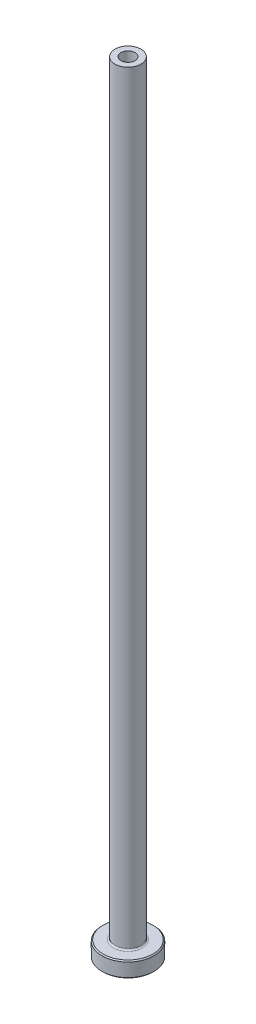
ISO-10303-21;
HEADER;
FILE_DESCRIPTION(('STEP AP214'),'2;1');
FILE_NAME('part.step','',(''),(''),'','','');
FILE_SCHEMA(('AUTOMOTIVE_DESIGN { 1 0 10303 214 1 1 1 1 }'));
ENDSEC;
DATA;
#1=APPLICATION_CONTEXT('core data for automotive mechanical design processes');
#2=APPLICATION_PROTOCOL_DEFINITION('international standard','automotive_design',2000,#1);
#3=PRODUCT_CONTEXT('',#1,'mechanical');
#4=PRODUCT('Part','Part','',(#3));
#5=PRODUCT_RELATED_PRODUCT_CATEGORY('part','',(#4));
#6=PRODUCT_DEFINITION_FORMATION('','',#4);
#7=PRODUCT_DEFINITION_CONTEXT('part definition',#1,'design');
#8=PRODUCT_DEFINITION('design','',#6,#7);
#9=PRODUCT_DEFINITION_SHAPE('','',#8);
#10=(LENGTH_UNIT() NAMED_UNIT(*) SI_UNIT(.MILLI.,.METRE.));
#11=(NAMED_UNIT(*) PLANE_ANGLE_UNIT() SI_UNIT($,.RADIAN.));
#12=(NAMED_UNIT(*) SI_UNIT($,.STERADIAN.) SOLID_ANGLE_UNIT());
#13=UNCERTAINTY_MEASURE_WITH_UNIT(LENGTH_MEASURE(1.E-05),#10,'distance_accuracy_value','');
#14=(GEOMETRIC_REPRESENTATION_CONTEXT(3) GLOBAL_UNCERTAINTY_ASSIGNED_CONTEXT((#13)) GLOBAL_UNIT_ASSIGNED_CONTEXT((#10,
#11,#12)) REPRESENTATION_CONTEXT('',''));
#15=CARTESIAN_POINT('',(0.,0.,0.));
#16=DIRECTION('',(0.,0.,1.));
#17=DIRECTION('',(1.,0.,0.));
#18=AXIS2_PLACEMENT_3D('',#15,#16,#17);
#19=CARTESIAN_POINT('',(0.,92.1876809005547,0.));
#20=DIRECTION('',(0.,1.,0.));
#21=DIRECTION('',(0.,0.,1.));
#22=AXIS2_PLACEMENT_3D('',#19,#20,#21);
#23=CYLINDRICAL_SURFACE('',#22,1.35);
#24=CARTESIAN_POINT('',(0.,150.,0.));
#25=DIRECTION('',(0.,1.,0.));
#26=DIRECTION('',(0.,0.,1.));
#27=AXIS2_PLACEMENT_3D('',#24,#25,#26);
#28=CIRCLE('',#27,1.35);
#29=CARTESIAN_POINT('',(0.,150.,1.35));
#30=VERTEX_POINT('',#29);
#31=EDGE_CURVE('E62',#30,#30,#28,.T.);
#32=ORIENTED_EDGE('',*,*,#31,.T.);
#33=EDGE_LOOP('',(#32));
#34=FACE_BOUND('',#33,.T.);
#35=CARTESIAN_POINT('',(0.,105.,0.));
#36=DIRECTION('',(0.,1.,0.));
#37=DIRECTION('',(0.,0.,1.));
#38=AXIS2_PLACEMENT_3D('',#35,#36,#37);
#39=CIRCLE('',#38,1.35);
#40=CARTESIAN_POINT('',(0.,105.,1.35));
#41=VERTEX_POINT('',#40);
#42=EDGE_CURVE('E71',#41,#41,#39,.T.);
#43=ORIENTED_EDGE('',*,*,#42,.F.);
#44=EDGE_LOOP('',(#43));
#45=FACE_BOUND('',#44,.T.);
#46=ADVANCED_FACE('F30',(#34,#45),#23,.F.);
#47=CARTESIAN_POINT('',(-1.35,150.,0.));
#48=DIRECTION('',(0.,1.,0.));
#49=DIRECTION('',(0.,0.,1.));
#50=AXIS2_PLACEMENT_3D('',#47,#48,#49);
#51=PLANE('',#50);
#52=CARTESIAN_POINT('',(0.,150.,0.));
#53=DIRECTION('',(0.,1.,0.));
#54=DIRECTION('',(0.,0.,1.));
#55=AXIS2_PLACEMENT_3D('',#52,#53,#54);
#56=CIRCLE('',#55,2.50000000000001);
#57=CARTESIAN_POINT('',(0.,150.,2.50000000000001));
#58=VERTEX_POINT('',#57);
#59=EDGE_CURVE('E65',#58,#58,#56,.T.);
#60=ORIENTED_EDGE('',*,*,#59,.T.);
#61=EDGE_LOOP('',(#60));
#62=FACE_BOUND('',#61,.T.);
#63=ORIENTED_EDGE('',*,*,#31,.F.);
#64=EDGE_LOOP('',(#63));
#65=FACE_BOUND('',#64,.T.);
#66=ADVANCED_FACE('F79',(#62,#65),#51,.T.);
#67=CARTESIAN_POINT('',(0.,92.1876809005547,0.));
#68=DIRECTION('',(0.,1.,0.));
#69=DIRECTION('',(0.,0.,1.));
#70=AXIS2_PLACEMENT_3D('',#67,#68,#69);
#71=CYLINDRICAL_SURFACE('',#70,2.5);
#72=CARTESIAN_POINT('',(0.,3.3,0.));
#73=DIRECTION('',(0.,1.,0.));
#74=DIRECTION('',(0.,0.,1.));
#75=AXIS2_PLACEMENT_3D('',#72,#73,#74);
#76=CIRCLE('',#75,2.5);
#77=CARTESIAN_POINT('',(0.,3.3,2.5));
#78=VERTEX_POINT('',#77);
#79=EDGE_CURVE('E59',#78,#78,#76,.T.);
#80=ORIENTED_EDGE('',*,*,#79,.T.);
#81=EDGE_LOOP('',(#80));
#82=FACE_BOUND('',#81,.T.);
#83=ORIENTED_EDGE('',*,*,#59,.F.);
#84=EDGE_LOOP('',(#83));
#85=FACE_BOUND('',#84,.T.);
#86=ADVANCED_FACE('F85',(#82,#85),#71,.T.);
#87=CARTESIAN_POINT('',(-2.49999999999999,3.,0.));
#88=DIRECTION('',(0.,1.,0.));
#89=DIRECTION('',(0.,0.,1.));
#90=AXIS2_PLACEMENT_3D('',#87,#88,#89);
#91=PLANE('',#90);
#92=CARTESIAN_POINT('',(0.,3.,0.));
#93=DIRECTION('',(0.,1.,0.));
#94=DIRECTION('',(0.,0.,1.));
#95=AXIS2_PLACEMENT_3D('',#92,#93,#94);
#96=CIRCLE('',#95,4.79999999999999);
#97=CARTESIAN_POINT('',(0.,3.,4.79999999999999));
#98=VERTEX_POINT('',#97);
#99=EDGE_CURVE('E53',#98,#98,#96,.T.);
#100=ORIENTED_EDGE('',*,*,#99,.T.);
#101=EDGE_LOOP('',(#100));
#102=FACE_BOUND('',#101,.T.);
#103=CARTESIAN_POINT('',(0.,3.,0.));
#104=DIRECTION('',(0.,1.,0.));
#105=DIRECTION('',(0.,0.,1.));
#106=AXIS2_PLACEMENT_3D('',#103,#104,#105);
#107=CIRCLE('',#106,2.8);
#108=CARTESIAN_POINT('',(0.,3.,2.8));
#109=VERTEX_POINT('',#108);
#110=EDGE_CURVE('E56',#109,#109,#107,.F.);
#111=ORIENTED_EDGE('',*,*,#110,.T.);
#112=EDGE_LOOP('',(#111));
#113=FACE_BOUND('',#112,.T.);
#114=ADVANCED_FACE('F111',(#102,#113),#91,.T.);
#115=CARTESIAN_POINT('',(0.,92.1876809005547,0.));
#116=DIRECTION('',(0.,1.,0.));
#117=DIRECTION('',(0.,0.,1.));
#118=AXIS2_PLACEMENT_3D('',#115,#116,#117);
#119=CYLINDRICAL_SURFACE('',#118,4.99999999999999);
#120=CARTESIAN_POINT('',(0.,2.8,0.));
#121=DIRECTION('',(0.,1.,0.));
#122=DIRECTION('',(0.,0.,1.));
#123=AXIS2_PLACEMENT_3D('',#120,#121,#122);
#124=CIRCLE('',#123,4.99999999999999);
#125=CARTESIAN_POINT('',(0.,2.8,4.99999999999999));
#126=VERTEX_POINT('',#125);
#127=EDGE_CURVE('E45',#126,#126,#124,.F.);
#128=ORIENTED_EDGE('',*,*,#127,.T.);
#129=EDGE_LOOP('',(#128));
#130=FACE_BOUND('',#129,.T.);
#131=CARTESIAN_POINT('',(0.,0.199999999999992,0.));
#132=DIRECTION('',(0.,-1.,0.));
#133=DIRECTION('',(0.,0.,-1.));
#134=AXIS2_PLACEMENT_3D('',#131,#132,#133);
#135=CIRCLE('',#134,4.99999999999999);
#136=CARTESIAN_POINT('',(0.,0.199999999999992,-4.99999999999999));
#137=VERTEX_POINT('',#136);
#138=EDGE_CURVE('E50',#137,#137,#135,.F.);
#139=ORIENTED_EDGE('',*,*,#138,.T.);
#140=EDGE_LOOP('',(#139));
#141=FACE_BOUND('',#140,.T.);
#142=ADVANCED_FACE('F108',(#130,#141),#119,.T.);
#143=CARTESIAN_POINT('',(-4.99999999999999,0.,0.));
#144=DIRECTION('',(0.,-1.,0.));
#145=DIRECTION('',(0.,0.,-1.));
#146=AXIS2_PLACEMENT_3D('',#143,#144,#145);
#147=PLANE('',#146);
#148=CARTESIAN_POINT('',(0.,0.,0.));
#149=DIRECTION('',(0.,-1.,0.));
#150=DIRECTION('',(0.,0.,-1.));
#151=AXIS2_PLACEMENT_3D('',#148,#149,#150);
#152=CIRCLE('',#151,2.09999999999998);
#153=CARTESIAN_POINT('',(0.,0.,-2.09999999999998));
#154=VERTEX_POINT('',#153);
#155=EDGE_CURVE('E37',#154,#154,#152,.F.);
#156=ORIENTED_EDGE('',*,*,#155,.T.);
#157=EDGE_LOOP('',(#156));
#158=FACE_BOUND('',#157,.T.);
#159=CARTESIAN_POINT('',(0.,0.,0.));
#160=DIRECTION('',(0.,-1.,0.));
#161=DIRECTION('',(0.,0.,-1.));
#162=AXIS2_PLACEMENT_3D('',#159,#160,#161);
#163=CIRCLE('',#162,4.8);
#164=CARTESIAN_POINT('',(0.,0.,-4.8));
#165=VERTEX_POINT('',#164);
#166=EDGE_CURVE('E41',#165,#165,#163,.T.);
#167=ORIENTED_EDGE('',*,*,#166,.T.);
#168=EDGE_LOOP('',(#167));
#169=FACE_BOUND('',#168,.T.);
#170=ADVANCED_FACE('F110',(#158,#169),#147,.T.);
#171=CARTESIAN_POINT('',(0.,92.1876809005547,0.));
#172=DIRECTION('',(0.,1.,0.));
#173=DIRECTION('',(0.,0.,1.));
#174=AXIS2_PLACEMENT_3D('',#171,#172,#173);
#175=CYLINDRICAL_SURFACE('',#174,1.6);
#176=CARTESIAN_POINT('',(0.,0.499999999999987,0.));
#177=DIRECTION('',(0.,-1.,0.));
#178=DIRECTION('',(0.,0.,-1.));
#179=AXIS2_PLACEMENT_3D('',#176,#177,#178);
#180=CIRCLE('',#179,1.6);
#181=CARTESIAN_POINT('',(0.,0.499999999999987,-1.6));
#182=VERTEX_POINT('',#181);
#183=EDGE_CURVE('E10',#182,#182,#180,.T.);
#184=ORIENTED_EDGE('',*,*,#183,.T.);
#185=EDGE_LOOP('',(#184));
#186=FACE_BOUND('',#185,.T.);
#187=CARTESIAN_POINT('',(0.,93.,0.));
#188=DIRECTION('',(0.,1.,0.));
#189=DIRECTION('',(0.,0.,1.));
#190=AXIS2_PLACEMENT_3D('',#187,#188,#189);
#191=CIRCLE('',#190,1.6);
#192=CARTESIAN_POINT('',(0.,93.,1.6));
#193=VERTEX_POINT('',#192);
#194=EDGE_CURVE('E68',#193,#193,#191,.T.);
#195=ORIENTED_EDGE('',*,*,#194,.T.);
#196=EDGE_LOOP('',(#195));
#197=FACE_BOUND('',#196,.T.);
#198=ADVANCED_FACE('F118',(#186,#197),#175,.F.);
#199=CARTESIAN_POINT('',(0.,93.,0.));
#200=DIRECTION('',(0.,-1.,0.));
#201=DIRECTION('',(0.,0.,-1.));
#202=AXIS2_PLACEMENT_3D('',#199,#200,#201);
#203=CONICAL_SURFACE('',#202,1.6,0.0208303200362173);
#204=ORIENTED_EDGE('',*,*,#42,.T.);
#205=EDGE_LOOP('',(#204));
#206=FACE_BOUND('',#205,.T.);
#207=ORIENTED_EDGE('',*,*,#194,.F.);
#208=EDGE_LOOP('',(#207));
#209=FACE_BOUND('',#208,.T.);
#210=ADVANCED_FACE('F75',(#206,#209),#203,.F.);
#211=CARTESIAN_POINT('',(0.,3.3,0.));
#212=DIRECTION('',(0.,1.,0.));
#213=DIRECTION('',(0.,0.,1.));
#214=AXIS2_PLACEMENT_3D('',#211,#212,#213);
#215=TOROIDAL_SURFACE('',#214,2.8,0.3);
#216=ORIENTED_EDGE('',*,*,#110,.F.);
#217=EDGE_LOOP('',(#216));
#218=FACE_BOUND('',#217,.T.);
#219=ORIENTED_EDGE('',*,*,#79,.F.);
#220=EDGE_LOOP('',(#219));
#221=FACE_BOUND('',#220,.T.);
#222=ADVANCED_FACE('F90',(#218,#221),#215,.F.);
#223=CARTESIAN_POINT('',(0.,3.,0.));
#224=DIRECTION('',(0.,-1.,0.));
#225=DIRECTION('',(0.,0.,-1.));
#226=AXIS2_PLACEMENT_3D('',#223,#224,#225);
#227=CONICAL_SURFACE('',#226,4.79999999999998,0.785398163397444);
#228=ORIENTED_EDGE('',*,*,#127,.F.);
#229=EDGE_LOOP('',(#228));
#230=FACE_BOUND('',#229,.T.);
#231=ORIENTED_EDGE('',*,*,#99,.F.);
#232=EDGE_LOOP('',(#231));
#233=FACE_BOUND('',#232,.T.);
#234=ADVANCED_FACE('F93',(#230,#233),#227,.T.);
#235=CARTESIAN_POINT('',(0.,0.199999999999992,0.));
#236=DIRECTION('',(0.,1.,0.));
#237=DIRECTION('',(0.,0.,1.));
#238=AXIS2_PLACEMENT_3D('',#235,#236,#237);
#239=CONICAL_SURFACE('',#238,4.99999999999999,0.785398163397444);
#240=ORIENTED_EDGE('',*,*,#166,.F.);
#241=EDGE_LOOP('',(#240));
#242=FACE_BOUND('',#241,.T.);
#243=ORIENTED_EDGE('',*,*,#138,.F.);
#244=EDGE_LOOP('',(#243));
#245=FACE_BOUND('',#244,.T.);
#246=ADVANCED_FACE('F96',(#242,#245),#239,.T.);
#247=CARTESIAN_POINT('',(0.,0.,0.));
#248=DIRECTION('',(0.,-1.,0.));
#249=DIRECTION('',(0.,0.,-1.));
#250=AXIS2_PLACEMENT_3D('',#247,#248,#249);
#251=CONICAL_SURFACE('',#250,2.09999999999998,0.785398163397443);
#252=ORIENTED_EDGE('',*,*,#183,.F.);
#253=EDGE_LOOP('',(#252));
#254=FACE_BOUND('',#253,.T.);
#255=ORIENTED_EDGE('',*,*,#155,.F.);
#256=EDGE_LOOP('',(#255));
#257=FACE_BOUND('',#256,.T.);
#258=ADVANCED_FACE('F32',(#254,#257),#251,.F.);
#259=CLOSED_SHELL('',(#46,#66,#86,#114,#142,#170,#198,#210,#222,#234,#246,#258));
#260=MANIFOLD_SOLID_BREP('B2',#259);
#261=ADVANCED_BREP_SHAPE_REPRESENTATION('',(#18,#260),#14);
#262=SHAPE_DEFINITION_REPRESENTATION(#9,#261);
ENDSEC;
END-ISO-10303-21;
